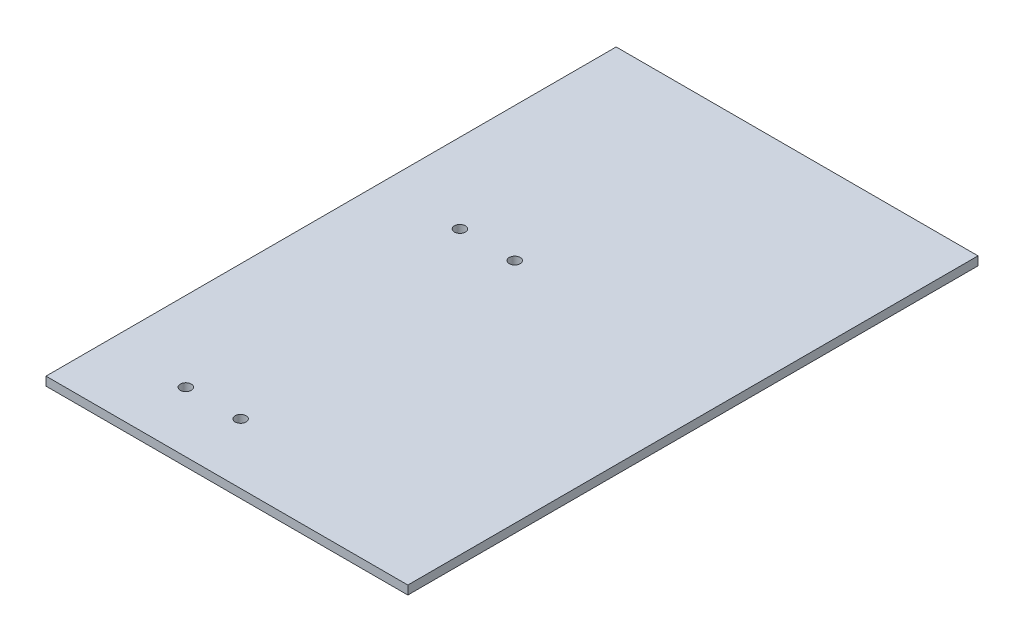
from build123d import *

# Parameters (mm, degrees)
ESQUISSE1_W             = 66
ESQUISSE1_H             = 104
BOSS_EXTRU_1_DEPTH      = 1.5875
ESQUISSE4_R             = 1
ENL_V_MAT_EXTRU_1_DEPTH = 1.5875


with BuildPart() as part:
    # Esquisse1 → Boss.-Extru.1 (new body)
    with BuildSketch(Plane(origin=(0, 0, 0), x_dir=(1, 0, 0), z_dir=(0, 1, 0))):
        Rectangle(ESQUISSE1_W, ESQUISSE1_H)
    extrude(amount=BOSS_EXTRU_1_DEPTH)

    # Esquisse4 → Enl_v. mat.-Extru.1 (cut)
    with BuildSketch(Plane(origin=(0, 1.5875, 0), x_dir=(1, 0, 0), z_dir=(0, 1, 0))):
        with Locations(Location((-18.5, 9, 0), (0, 0, 270))):
            Circle(ESQUISSE4_R)
        with Locations(Location((-8.5, 9, 0), (0, 0, 270))):
            Circle(ESQUISSE4_R)
        with Locations(Location((-8.5, -41, 0), (0, 0, 270))):
            Circle(ESQUISSE4_R)
        with Locations(Location((-18.5, -41, 0), (0, 0, 270))):
            Circle(ESQUISSE4_R)
    extrude(amount=-ENL_V_MAT_EXTRU_1_DEPTH, mode=Mode.SUBTRACT)


solid = part.part
